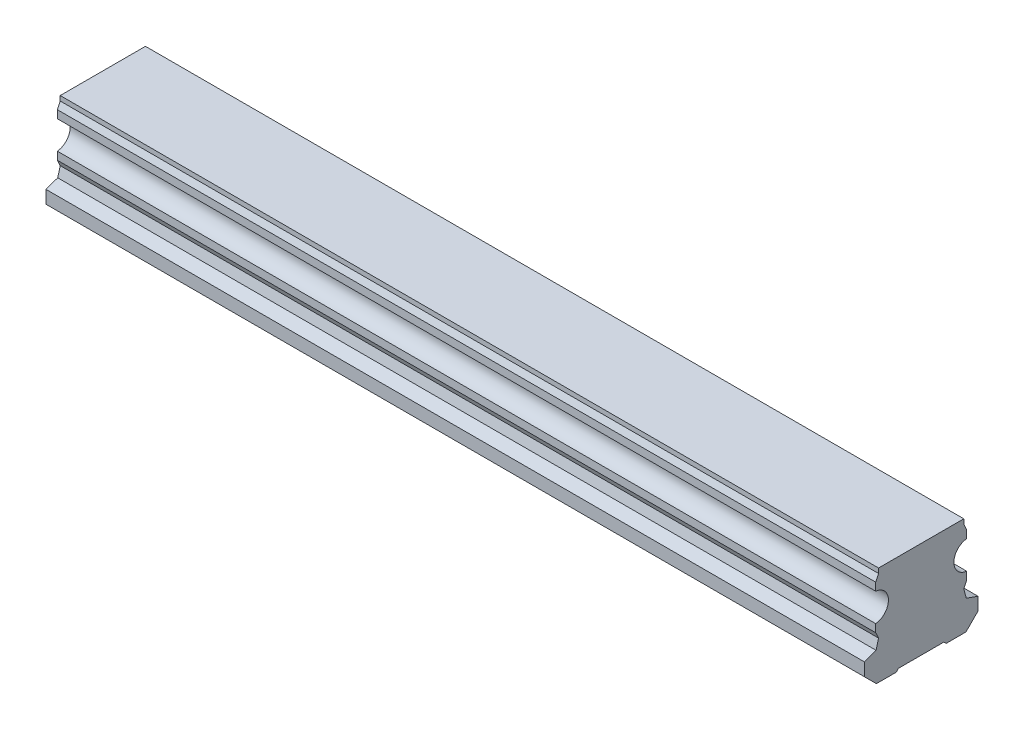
from build123d import *

# Parameters (mm, degrees)
BOSS_EXTRUDE1_DEPTH        = 180
SKETCH3_R                  = 3
SKETCH3_R_2                = 2.5
CUT_EXTRUDE3_DEPTH         = 12
SKETCH3_2_R                = 2.5
CUT_EXTRUDE4_DEPTH         = 15
CHAMFER1_SIZE              = 0.5
LPATTERN4_COUNT            = 3
LPATTERN4_PITCH            = 60
CHAMFER1_OF_LPATTERN4_SIZE = 0.5


with BuildPart() as part:
    # Sketch1 → Boss-Extrude1 (new body)
    with BuildSketch(Plane(origin=(0, 0, 0), x_dir=(0, 0, -1), z_dir=(1, 0, 0))):
        with BuildLine():
            Line((9.375, 21.8), (-9.375, 21.8))
            Line((-9.375, 21.8), (-9.375, 20.756))
            Line((-9.375, 20.756), (-10, 19.415683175))
            Line((-10, 19.415683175), (-10, 17.685449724))
            ThreePointArc((-10, 17.685449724), (-7.2, 14.6), (-10, 11.514550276))
            Line((-10, 11.514550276), (-10, 9.784316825))
            Line((-10, 9.784316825), (-9.375, 8.444))
            Line((-9.375, 8.444), (-9.922688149, 6.4))
            Line((-9.922688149, 6.4), (-12.5, 5.489338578))
            Line((-12.5, 5.489338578), (-12.5, 2.65))
            Line((-12.5, 2.65), (-9.85, 0))
            Line((-9.85, 0), (-5.5, 0))
            Line((-5.5, 0), (-5, 0.5))
            Line((-5, 0.5), (5, 0.5))
            Line((5, 0.5), (5.5, 0))
            Line((5.5, 0), (9.85, 0))
            Line((9.85, 0), (12.5, 2.65))
            Line((12.5, 2.65), (12.5, 5.489338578))
            Line((12.5, 5.489338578), (9.922688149, 6.4))
            Line((9.922688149, 6.4), (9.375, 8.444))
            Line((9.375, 8.444), (10, 9.784316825))
            Line((10, 9.784316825), (10, 11.514550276))
            ThreePointArc((10, 11.514550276), (7.2, 14.6), (10, 17.685449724))
            Line((10, 17.685449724), (10, 19.415683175))
            Line((10, 19.415683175), (9.375, 20.756))
            Line((9.375, 20.756), (9.375, 21.8))
        make_face()
    extrude(amount=BOSS_EXTRUDE1_DEPTH)

    # Sketch3 → Cut-Extrude3 (cut)
    with BuildSketch(Plane.XZ):
        with Locations(Location((30, 0, 0), (0, 0, 270))):
            Circle(SKETCH3_R)
        with Locations(Location((30, 0, 0), (0, 0, 270))):
            Circle(SKETCH3_R_2, mode=Mode.SUBTRACT)
    cut_extrude3 = extrude(amount=-CUT_EXTRUDE3_DEPTH, mode=Mode.SUBTRACT)

    # Sketch3_2 → Cut-Extrude4 (cut)
    with BuildSketch(Plane.XZ):
        with Locations(Location((30, 0, 0), (0, 0, 270))):
            Circle(SKETCH3_2_R)
    cut_extrude4 = extrude(amount=-CUT_EXTRUDE4_DEPTH, mode=Mode.SUBTRACT)

    # Cut-Extrude5 cone 1 section (on through the dimple's axis) → Cut-Extrude5 (revolve, cut)
    with BuildSketch(Plane(origin=(30, 15, 0), x_dir=(0, 0, -1), z_dir=(1, 0, 0))):
        Polygon((0, 0), (2.5, 0), (0, 1.443375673), align=None)
    cut_extrude5 = revolve(axis=Axis((30, 15, 0), (0, 1, 0)), mode=Mode.SUBTRACT)

    # Chamfer1
    chamfer1_edges = [part.edges().sort_by_distance(p)[0] for p in [
        (30, 0.5, 3),
    ]]
    chamfer(chamfer1_edges, length=CHAMFER1_SIZE)

    # LPattern4: Cut-Extrude3, Cut-Extrude4, Cut-Extrude5 ×3
    with Locations(*[(i * LPATTERN4_PITCH, 0, 0) for i in range(1, LPATTERN4_COUNT)]):
        add(cut_extrude3, mode=Mode.SUBTRACT)
        add(cut_extrude4, mode=Mode.SUBTRACT)
        add(cut_extrude5, mode=Mode.SUBTRACT)

    # Chamfer1 of LPattern4
    chamfer1_of_lpattern4_edges = [part.edges().sort_by_distance(p)[0] for p in [
        (90, 0.5, 3),
        (150, 0.5, 3),
    ]]
    chamfer(chamfer1_of_lpattern4_edges, length=CHAMFER1_OF_LPATTERN4_SIZE)


solid = part.part
